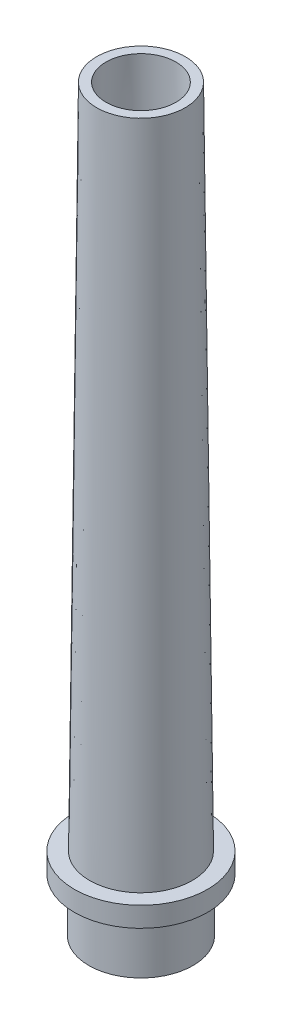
from build123d import *

# Parameters (mm, degrees)
SKETCH_4_R      = 7.825
SKETCH_4_R_2    = 6.125
EXTRUDE_1_DEPTH = 8
SKETCH_5_R      = 10
SKETCH_5_R_2    = 6.859993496
EXTRUDE_2_DEPTH = 3


with BuildPart() as part:
    # Sketch 3 → Revolve 1 (revolve)
    with BuildSketch(Plane.XY, mode=Mode.PRIVATE) as revolve_1_sk:
        Polygon((7.825, 0), (6.65, 111), (5.25, 111), (6.125, 0), align=None)
    revolve(revolve_1_sk.sketch.rotate(Axis((0, 122.78663607, 0), (0, -1, 0)), 90), axis=Axis((0, 122.78663607, 0), (0, -1, 0)))

    # Sketch 4 → Extrude 1 (add)
    with BuildSketch(Plane.XZ):
        with Locations(Location((0, 0, 0), (0, 0, 270))):
            Circle(SKETCH_4_R)
        Circle(SKETCH_4_R_2, mode=Mode.SUBTRACT)
    extrude(amount=-EXTRUDE_1_DEPTH)

    # Sketch 5 → Extrude 2 (add)
    with BuildSketch(Plane(origin=(0, 8, 0), x_dir=(1, 0, 0), z_dir=(0, 1, 0))):
        with Locations(Location((0, 0, 0), (0, 0, 270))):
            Circle(SKETCH_5_R)
        Circle(SKETCH_5_R_2, mode=Mode.SUBTRACT)
    extrude(amount=EXTRUDE_2_DEPTH)


solid = part.part
